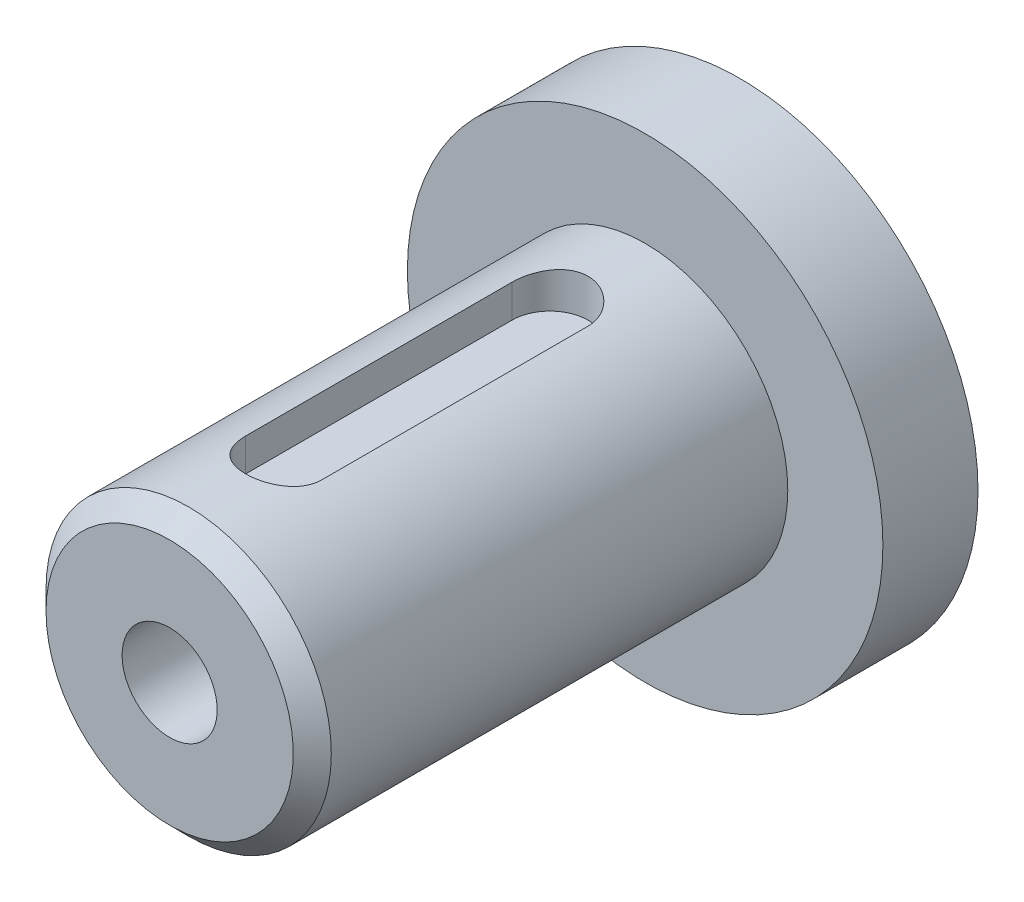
ISO-10303-21;
HEADER;
FILE_DESCRIPTION(('STEP AP214'),'2;1');
FILE_NAME('part.step','',(''),(''),'','','');
FILE_SCHEMA(('AUTOMOTIVE_DESIGN { 1 0 10303 214 1 1 1 1 }'));
ENDSEC;
DATA;
#1=APPLICATION_CONTEXT('core data for automotive mechanical design processes');
#2=APPLICATION_PROTOCOL_DEFINITION('international standard','automotive_design',2000,#1);
#3=PRODUCT_CONTEXT('',#1,'mechanical');
#4=PRODUCT('Part','Part','',(#3));
#5=PRODUCT_RELATED_PRODUCT_CATEGORY('part','',(#4));
#6=PRODUCT_DEFINITION_FORMATION('','',#4);
#7=PRODUCT_DEFINITION_CONTEXT('part definition',#1,'design');
#8=PRODUCT_DEFINITION('design','',#6,#7);
#9=PRODUCT_DEFINITION_SHAPE('','',#8);
#10=(LENGTH_UNIT() NAMED_UNIT(*) SI_UNIT(.MILLI.,.METRE.));
#11=(NAMED_UNIT(*) PLANE_ANGLE_UNIT() SI_UNIT($,.RADIAN.));
#12=(NAMED_UNIT(*) SI_UNIT($,.STERADIAN.) SOLID_ANGLE_UNIT());
#13=UNCERTAINTY_MEASURE_WITH_UNIT(LENGTH_MEASURE(1.E-05),#10,'distance_accuracy_value','');
#14=(GEOMETRIC_REPRESENTATION_CONTEXT(3) GLOBAL_UNCERTAINTY_ASSIGNED_CONTEXT((#13)) GLOBAL_UNIT_ASSIGNED_CONTEXT((#10,
#11,#12)) REPRESENTATION_CONTEXT('',''));
#15=CARTESIAN_POINT('',(0.,0.,0.));
#16=DIRECTION('',(0.,0.,1.));
#17=DIRECTION('',(1.,0.,0.));
#18=AXIS2_PLACEMENT_3D('',#15,#16,#17);
#19=CARTESIAN_POINT('',(0.,0.,10.));
#20=DIRECTION('',(0.,0.,1.));
#21=DIRECTION('',(0.,-1.,0.));
#22=AXIS2_PLACEMENT_3D('',#19,#20,#21);
#23=CONICAL_SURFACE('',#22,5.,1.02974425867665);
#24=CARTESIAN_POINT('',(0.,0.,10.));
#25=DIRECTION('',(0.,0.,1.));
#26=DIRECTION('',(0.,-1.,0.));
#27=AXIS2_PLACEMENT_3D('',#24,#25,#26);
#28=CIRCLE('',#27,5.);
#29=CARTESIAN_POINT('',(0.,-5.,10.));
#30=VERTEX_POINT('',#29);
#31=EDGE_CURVE('E141',#30,#30,#28,.T.);
#32=ORIENTED_EDGE('',*,*,#31,.T.);
#33=EDGE_LOOP('',(#32));
#34=FACE_BOUND('',#33,.T.);
#35=CARTESIAN_POINT('',(0.,0.,6.9956969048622));
#36=VERTEX_POINT('',#35);
#37=VERTEX_LOOP('',#36);
#38=FACE_BOUND('',#37,.T.);
#39=ADVANCED_FACE('F16',(#34,#38),#23,.F.);
#40=CARTESIAN_POINT('',(0.,0.,-10.));
#41=DIRECTION('',(0.,0.,1.));
#42=DIRECTION('',(1.,0.,0.));
#43=AXIS2_PLACEMENT_3D('',#40,#41,#42);
#44=PLANE('',#43);
#45=CARTESIAN_POINT('',(0.,0.,-10.));
#46=DIRECTION('',(0.,0.,-1.));
#47=DIRECTION('',(-1.,0.,0.));
#48=AXIS2_PLACEMENT_3D('',#45,#46,#47);
#49=CIRCLE('',#48,25.);
#50=CARTESIAN_POINT('',(-25.,0.,-10.));
#51=VERTEX_POINT('',#50);
#52=EDGE_CURVE('E20',#51,#51,#49,.F.);
#53=ORIENTED_EDGE('',*,*,#52,.F.);
#54=EDGE_LOOP('',(#53));
#55=FACE_BOUND('',#54,.T.);
#56=ADVANCED_FACE('F62',(#55),#44,.F.);
#57=CARTESIAN_POINT('',(0.,11.,24.));
#58=DIRECTION('',(0.,1.,0.));
#59=DIRECTION('',(0.,0.,1.));
#60=AXIS2_PLACEMENT_3D('',#57,#58,#59);
#61=PLANE('',#60);
#62=CARTESIAN_POINT('',(0.,11.,38.));
#63=DIRECTION('',(0.,-1.,0.));
#64=DIRECTION('',(0.,0.,-1.));
#65=AXIS2_PLACEMENT_3D('',#62,#63,#64);
#66=CIRCLE('',#65,4.);
#67=CARTESIAN_POINT('',(-4.,11.,38.));
#68=VERTEX_POINT('',#67);
#69=CARTESIAN_POINT('',(4.,11.,38.));
#70=VERTEX_POINT('',#69);
#71=EDGE_CURVE('E133',#68,#70,#66,.F.);
#72=ORIENTED_EDGE('',*,*,#71,.T.);
#73=DIRECTION('',(0.,0.,-1.));
#74=VECTOR('',#73,1.);
#75=CARTESIAN_POINT('',(4.,11.,38.));
#76=LINE('',#75,#74);
#77=CARTESIAN_POINT('',(4.,11.,10.));
#78=VERTEX_POINT('',#77);
#79=EDGE_CURVE('E57',#70,#78,#76,.T.);
#80=ORIENTED_EDGE('',*,*,#79,.T.);
#81=CARTESIAN_POINT('',(0.,11.,10.));
#82=DIRECTION('',(0.,-1.,0.));
#83=DIRECTION('',(0.,0.,-1.));
#84=AXIS2_PLACEMENT_3D('',#81,#82,#83);
#85=CIRCLE('',#84,4.);
#86=CARTESIAN_POINT('',(-4.,11.,10.));
#87=VERTEX_POINT('',#86);
#88=EDGE_CURVE('E136',#78,#87,#85,.F.);
#89=ORIENTED_EDGE('',*,*,#88,.T.);
#90=DIRECTION('',(0.,0.,1.));
#91=VECTOR('',#90,1.);
#92=CARTESIAN_POINT('',(-4.,11.,10.));
#93=LINE('',#92,#91);
#94=EDGE_CURVE('E158',#87,#68,#93,.T.);
#95=ORIENTED_EDGE('',*,*,#94,.T.);
#96=EDGE_LOOP('',(#72,#80,#89,#95));
#97=FACE_BOUND('',#96,.T.);
#98=ADVANCED_FACE('F67',(#97),#61,.T.);
#99=CARTESIAN_POINT('',(0.,0.,50.));
#100=DIRECTION('',(0.,0.,-1.));
#101=DIRECTION('',(0.,1.,0.));
#102=AXIS2_PLACEMENT_3D('',#99,#100,#101);
#103=CYLINDRICAL_SURFACE('',#102,5.);
#104=ORIENTED_EDGE('',*,*,#31,.F.);
#105=EDGE_LOOP('',(#104));
#106=FACE_BOUND('',#105,.T.);
#107=CARTESIAN_POINT('',(0.,0.,50.));
#108=DIRECTION('',(0.,0.,-1.));
#109=DIRECTION('',(0.,1.,0.));
#110=AXIS2_PLACEMENT_3D('',#107,#108,#109);
#111=CIRCLE('',#110,5.);
#112=CARTESIAN_POINT('',(0.,5.,50.));
#113=VERTEX_POINT('',#112);
#114=EDGE_CURVE('E128',#113,#113,#111,.F.);
#115=ORIENTED_EDGE('',*,*,#114,.T.);
#116=EDGE_LOOP('',(#115));
#117=FACE_BOUND('',#116,.T.);
#118=ADVANCED_FACE('F18',(#106,#117),#103,.F.);
#119=CARTESIAN_POINT('',(0.,0.,0.));
#120=DIRECTION('',(0.,0.,-1.));
#121=DIRECTION('',(-1.,0.,0.));
#122=AXIS2_PLACEMENT_3D('',#119,#120,#121);
#123=CYLINDRICAL_SURFACE('',#122,25.);
#124=ORIENTED_EDGE('',*,*,#52,.T.);
#125=EDGE_LOOP('',(#124));
#126=FACE_BOUND('',#125,.T.);
#127=CARTESIAN_POINT('',(0.,0.,0.));
#128=DIRECTION('',(0.,0.,-1.));
#129=DIRECTION('',(-1.,0.,0.));
#130=AXIS2_PLACEMENT_3D('',#127,#128,#129);
#131=CIRCLE('',#130,25.);
#132=CARTESIAN_POINT('',(-25.,0.,0.));
#133=VERTEX_POINT('',#132);
#134=EDGE_CURVE('E126',#133,#133,#131,.F.);
#135=ORIENTED_EDGE('',*,*,#134,.F.);
#136=EDGE_LOOP('',(#135));
#137=FACE_BOUND('',#136,.T.);
#138=ADVANCED_FACE('F169',(#126,#137),#123,.T.);
#139=CARTESIAN_POINT('',(0.,15.,10.));
#140=DIRECTION('',(0.,-1.,0.));
#141=DIRECTION('',(0.,0.,-1.));
#142=AXIS2_PLACEMENT_3D('',#139,#140,#141);
#143=CYLINDRICAL_SURFACE('',#142,4.);
#144=ORIENTED_EDGE('',*,*,#88,.F.);
#145=DIRECTION('',(0.,1.,0.));
#146=VECTOR('',#145,1.);
#147=CARTESIAN_POINT('',(4.,15.,10.));
#148=LINE('',#147,#146);
#149=CARTESIAN_POINT('',(4.,14.456832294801,10.));
#150=VERTEX_POINT('',#149);
#151=EDGE_CURVE('E138',#78,#150,#148,.T.);
#152=ORIENTED_EDGE('',*,*,#151,.T.);
#153=CARTESIAN_POINT('',(-4.,14.456832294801,10.));
#154=CARTESIAN_POINT('',(-4.00001309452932,14.4568189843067,9.88964181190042));
#155=CARTESIAN_POINT('',(-3.9954331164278,14.4580956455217,9.77929158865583));
#156=CARTESIAN_POINT('',(-3.97718876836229,14.463130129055,9.55942156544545));
#157=CARTESIAN_POINT('',(-3.96352608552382,14.4668874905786,9.44990161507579));
#158=CARTESIAN_POINT('',(-3.92725701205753,14.4767740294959,9.23269861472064));
#159=CARTESIAN_POINT('',(-3.9046698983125,14.4828980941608,9.12501212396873));
#160=CARTESIAN_POINT('',(-3.85076546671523,14.4973231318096,8.91202524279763));
#161=CARTESIAN_POINT('',(-3.81944799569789,14.5056241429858,8.80672489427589));
#162=CARTESIAN_POINT('',(-3.71275524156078,14.5334415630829,8.49553303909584));
#163=CARTESIAN_POINT('',(-3.62460040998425,14.5558837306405,8.29411818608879));
#164=CARTESIAN_POINT('',(-3.41695360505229,14.6060180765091,7.90897292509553));
#165=CARTESIAN_POINT('',(-3.29745234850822,14.6337118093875,7.7252477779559));
#166=CARTESIAN_POINT('',(-3.02731689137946,14.6919987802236,7.37604663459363));
#167=CARTESIAN_POINT('',(-2.87604640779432,14.7226429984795,7.21107044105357));
#168=CARTESIAN_POINT('',(-2.54799127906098,14.7829465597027,6.90846910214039));
#169=CARTESIAN_POINT('',(-2.37119756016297,14.8126055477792,6.77085372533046));
#170=CARTESIAN_POINT('',(-1.99358309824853,14.8681744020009,6.52476686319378));
#171=CARTESIAN_POINT('',(-1.79241548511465,14.894014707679,6.41681104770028));
#172=CARTESIAN_POINT('',(-1.3741175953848,14.9384017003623,6.23655240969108));
#173=CARTESIAN_POINT('',(-1.15700689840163,14.9569571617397,6.16420666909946));
#174=CARTESIAN_POINT('',(-0.782359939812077,14.9803695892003,6.07410246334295));
#175=CARTESIAN_POINT('',(-0.627304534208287,14.9876923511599,6.04636352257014));
#176=CARTESIAN_POINT('',(-0.314853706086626,14.9975096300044,6.00930907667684));
#177=CARTESIAN_POINT('',(-0.157458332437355,15.0000042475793,5.9999931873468));
#178=CARTESIAN_POINT('',(0.220420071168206,14.9999940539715,6.00000953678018));
#179=CARTESIAN_POINT('',(0.440963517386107,14.9950912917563,6.01828798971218));
#180=CARTESIAN_POINT('',(0.875763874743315,14.9759985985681,6.09081667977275));
#181=CARTESIAN_POINT('',(1.09001471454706,14.9617999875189,6.14510053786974));
#182=CARTESIAN_POINT('',(1.50578787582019,14.9256858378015,6.28774616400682));
#183=CARTESIAN_POINT('',(1.7073285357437,14.9037817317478,6.376057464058));
#184=CARTESIAN_POINT('',(2.09272123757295,14.8545720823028,6.58408304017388));
#185=CARTESIAN_POINT('',(2.27657335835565,14.8272665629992,6.70379717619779));
#186=CARTESIAN_POINT('',(2.62565449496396,14.7694930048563,6.97416337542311));
#187=CARTESIAN_POINT('',(2.79041516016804,14.738970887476,7.12540858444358));
#188=CARTESIAN_POINT('',(3.09256794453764,14.6785495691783,7.45328993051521));
#189=CARTESIAN_POINT('',(3.22995522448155,14.6486504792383,7.62993054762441));
#190=CARTESIAN_POINT('',(3.47576504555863,14.5923023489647,8.00734886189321));
#191=CARTESIAN_POINT('',(3.58363993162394,14.5659226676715,8.20849416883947));
#192=CARTESIAN_POINT('',(3.76379877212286,14.5204168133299,8.62683450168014));
#193=CARTESIAN_POINT('',(3.83611089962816,14.5012849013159,8.84401666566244));
#194=CARTESIAN_POINT('',(3.9260816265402,14.4771319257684,9.21861127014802));
#195=CARTESIAN_POINT('',(3.95375335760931,14.4695705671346,9.37352744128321));
#196=CARTESIAN_POINT('',(3.99072640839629,14.4593983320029,9.68559999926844));
#197=CARTESIAN_POINT('',(4.00003858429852,14.456784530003,9.84275500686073));
#198=CARTESIAN_POINT('',(4.,14.456832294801,10.));
#199=B_SPLINE_CURVE_WITH_KNOTS('',3,(#153,#154,#155,#156,#157,#158,#159,#160,#161,#162,#163,
#164,#165,#166,#167,#168,#169,#170,#171,#172,#173,#174,#175,#176,#177,#178,#179,#180,#181,#182,
#183,#184,#185,#186,#187,#188,#189,#190,#191,#192,#193,#194,#195,#196,#197,#198),.UNSPECIFIED.,
.F.,.F.,(4,2,2,2,2,2,2,2,2,2,2,2,2,2,2,2,2,2,2,2,2,2,4),(0.,0.3309585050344,0.66185555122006,
0.992041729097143,1.32223370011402,1.9819182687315,2.64179842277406,3.31643087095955,
3.99130375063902,4.67725851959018,5.36238452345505,5.83435156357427,6.306308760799,
6.96698411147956,7.62827725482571,8.28859334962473,8.94890649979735,9.62299055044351,
10.2971936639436,10.9831693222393,11.6686006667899,12.1401499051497,12.6114202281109),.UNSPECIFIED.);
#200=CARTESIAN_POINT('',(-4.,14.456832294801,10.));
#201=VERTEX_POINT('',#200);
#202=EDGE_CURVE('E87',#201,#150,#199,.T.);
#203=ORIENTED_EDGE('',*,*,#202,.F.);
#204=DIRECTION('',(0.,1.,0.));
#205=VECTOR('',#204,1.);
#206=CARTESIAN_POINT('',(-4.,15.,10.));
#207=LINE('',#206,#205);
#208=EDGE_CURVE('E134',#201,#87,#207,.F.);
#209=ORIENTED_EDGE('',*,*,#208,.T.);
#210=EDGE_LOOP('',(#144,#152,#203,#209));
#211=FACE_BOUND('',#210,.T.);
#212=ADVANCED_FACE('F168',(#211),#143,.F.);
#213=CARTESIAN_POINT('',(4.,15.,38.));
#214=DIRECTION('',(1.,0.,0.));
#215=DIRECTION('',(0.,0.,-1.));
#216=AXIS2_PLACEMENT_3D('',#213,#214,#215);
#217=PLANE('',#216);
#218=ORIENTED_EDGE('',*,*,#151,.F.);
#219=ORIENTED_EDGE('',*,*,#79,.F.);
#220=DIRECTION('',(0.,-1.,0.));
#221=VECTOR('',#220,1.);
#222=CARTESIAN_POINT('',(4.,15.,38.));
#223=LINE('',#222,#221);
#224=CARTESIAN_POINT('',(4.,14.456832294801,38.));
#225=VERTEX_POINT('',#224);
#226=EDGE_CURVE('E135',#70,#225,#223,.F.);
#227=ORIENTED_EDGE('',*,*,#226,.T.);
#228=DIRECTION('',(0.,0.,1.));
#229=VECTOR('',#228,1.);
#230=CARTESIAN_POINT('',(3.99999999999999,14.456832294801,0.));
#231=LINE('',#230,#229);
#232=EDGE_CURVE('E102',#150,#225,#231,.T.);
#233=ORIENTED_EDGE('',*,*,#232,.F.);
#234=EDGE_LOOP('',(#218,#219,#227,#233));
#235=FACE_BOUND('',#234,.T.);
#236=ADVANCED_FACE('F111',(#235),#217,.F.);
#237=CARTESIAN_POINT('',(0.,15.,38.));
#238=DIRECTION('',(0.,-1.,0.));
#239=DIRECTION('',(0.,0.,-1.));
#240=AXIS2_PLACEMENT_3D('',#237,#238,#239);
#241=CYLINDRICAL_SURFACE('',#240,4.);
#242=ORIENTED_EDGE('',*,*,#71,.F.);
#243=DIRECTION('',(0.,1.,0.));
#244=VECTOR('',#243,1.);
#245=CARTESIAN_POINT('',(-4.,15.,38.));
#246=LINE('',#245,#244);
#247=CARTESIAN_POINT('',(-4.,14.456832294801,38.));
#248=VERTEX_POINT('',#247);
#249=EDGE_CURVE('E35',#68,#248,#246,.T.);
#250=ORIENTED_EDGE('',*,*,#249,.T.);
#251=CARTESIAN_POINT('',(4.,14.456832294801,38.));
#252=CARTESIAN_POINT('',(4.00001309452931,14.4568189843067,38.1103581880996));
#253=CARTESIAN_POINT('',(3.99543311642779,14.4580956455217,38.2207084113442));
#254=CARTESIAN_POINT('',(3.97718876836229,14.463130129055,38.4405784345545));
#255=CARTESIAN_POINT('',(3.96352608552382,14.4668874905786,38.5500983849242));
#256=CARTESIAN_POINT('',(3.92725701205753,14.4767740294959,38.7673013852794));
#257=CARTESIAN_POINT('',(3.9046698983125,14.4828980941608,38.8749878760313));
#258=CARTESIAN_POINT('',(3.85076546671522,14.4973231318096,39.0879747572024));
#259=CARTESIAN_POINT('',(3.81944799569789,14.5056241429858,39.1932751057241));
#260=CARTESIAN_POINT('',(3.71275524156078,14.5334415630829,39.5044669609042));
#261=CARTESIAN_POINT('',(3.62460040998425,14.5558837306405,39.7058818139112));
#262=CARTESIAN_POINT('',(3.41695360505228,14.6060180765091,40.0910270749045));
#263=CARTESIAN_POINT('',(3.29745234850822,14.6337118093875,40.2747522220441));
#264=CARTESIAN_POINT('',(3.02731689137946,14.6919987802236,40.6239533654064));
#265=CARTESIAN_POINT('',(2.87604640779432,14.7226429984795,40.7889295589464));
#266=CARTESIAN_POINT('',(2.54799127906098,14.7829465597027,41.0915308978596));
#267=CARTESIAN_POINT('',(2.37119756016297,14.8126055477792,41.2291462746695));
#268=CARTESIAN_POINT('',(1.99358309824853,14.8681744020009,41.4752331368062));
#269=CARTESIAN_POINT('',(1.79241548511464,14.894014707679,41.5831889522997));
#270=CARTESIAN_POINT('',(1.37411759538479,14.9384017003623,41.7634475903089));
#271=CARTESIAN_POINT('',(1.15700689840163,14.9569571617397,41.8357933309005));
#272=CARTESIAN_POINT('',(0.782359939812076,14.9803695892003,41.9258975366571));
#273=CARTESIAN_POINT('',(0.627304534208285,14.9876923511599,41.9536364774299));
#274=CARTESIAN_POINT('',(0.314853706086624,14.9975096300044,41.9906909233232));
#275=CARTESIAN_POINT('',(0.157458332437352,15.0000042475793,42.0000068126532));
#276=CARTESIAN_POINT('',(-0.220420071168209,14.9999940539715,41.9999904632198));
#277=CARTESIAN_POINT('',(-0.44096351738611,14.9950912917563,41.9817120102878));
#278=CARTESIAN_POINT('',(-0.875763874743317,14.9759985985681,41.9091833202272));
#279=CARTESIAN_POINT('',(-1.09001471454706,14.9617999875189,41.8548994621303));
#280=CARTESIAN_POINT('',(-1.50578787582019,14.9256858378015,41.7122538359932));
#281=CARTESIAN_POINT('',(-1.7073285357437,14.9037817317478,41.623942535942));
#282=CARTESIAN_POINT('',(-2.09272123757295,14.8545720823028,41.4159169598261));
#283=CARTESIAN_POINT('',(-2.27657335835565,14.8272665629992,41.2962028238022));
#284=CARTESIAN_POINT('',(-2.62565449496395,14.7694930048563,41.0258366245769));
#285=CARTESIAN_POINT('',(-2.79041516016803,14.738970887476,40.8745914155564));
#286=CARTESIAN_POINT('',(-3.09256794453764,14.6785495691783,40.5467100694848));
#287=CARTESIAN_POINT('',(-3.22995522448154,14.6486504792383,40.3700694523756));
#288=CARTESIAN_POINT('',(-3.47576504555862,14.5923023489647,39.9926511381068));
#289=CARTESIAN_POINT('',(-3.58363993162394,14.5659226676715,39.7915058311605));
#290=CARTESIAN_POINT('',(-3.76379877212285,14.5204168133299,39.3731654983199));
#291=CARTESIAN_POINT('',(-3.83611089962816,14.5012849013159,39.1559833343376));
#292=CARTESIAN_POINT('',(-3.9260816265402,14.4771319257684,38.781388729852));
#293=CARTESIAN_POINT('',(-3.95375335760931,14.4695705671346,38.6264725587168));
#294=CARTESIAN_POINT('',(-3.99072640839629,14.4593983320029,38.3144000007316));
#295=CARTESIAN_POINT('',(-4.00003858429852,14.456784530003,38.1572449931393));
#296=CARTESIAN_POINT('',(-3.99999999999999,14.456832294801,38.));
#297=B_SPLINE_CURVE_WITH_KNOTS('',3,(#251,#252,#253,#254,#255,#256,#257,#258,#259,#260,#261,
#262,#263,#264,#265,#266,#267,#268,#269,#270,#271,#272,#273,#274,#275,#276,#277,#278,#279,#280,
#281,#282,#283,#284,#285,#286,#287,#288,#289,#290,#291,#292,#293,#294,#295,#296),.UNSPECIFIED.,
.F.,.F.,(4,2,2,2,2,2,2,2,2,2,2,2,2,2,2,2,2,2,2,2,2,2,4),(0.,0.330958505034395,0.661855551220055,
0.992041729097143,1.32223370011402,1.98191826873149,2.64179842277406,3.31643087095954,
3.99130375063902,4.67725851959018,5.36238452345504,5.83435156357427,6.30630876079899,
6.96698411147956,7.62827725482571,8.28859334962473,8.94890649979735,9.62299055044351,
10.2971936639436,10.9831693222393,11.6686006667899,12.1401499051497,12.6114202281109),.UNSPECIFIED.);
#298=EDGE_CURVE('E94',#225,#248,#297,.T.);
#299=ORIENTED_EDGE('',*,*,#298,.F.);
#300=ORIENTED_EDGE('',*,*,#226,.F.);
#301=EDGE_LOOP('',(#242,#250,#299,#300));
#302=FACE_BOUND('',#301,.T.);
#303=ADVANCED_FACE('F105',(#302),#241,.F.);
#304=CARTESIAN_POINT('',(-4.,15.,10.));
#305=DIRECTION('',(-1.,0.,0.));
#306=DIRECTION('',(0.,0.,1.));
#307=AXIS2_PLACEMENT_3D('',#304,#305,#306);
#308=PLANE('',#307);
#309=ORIENTED_EDGE('',*,*,#249,.F.);
#310=ORIENTED_EDGE('',*,*,#94,.F.);
#311=ORIENTED_EDGE('',*,*,#208,.F.);
#312=DIRECTION('',(0.,0.,1.));
#313=VECTOR('',#312,1.);
#314=CARTESIAN_POINT('',(-3.99999999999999,14.456832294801,0.));
#315=LINE('',#314,#313);
#316=EDGE_CURVE('E101',#248,#201,#315,.F.);
#317=ORIENTED_EDGE('',*,*,#316,.F.);
#318=EDGE_LOOP('',(#309,#310,#311,#317));
#319=FACE_BOUND('',#318,.T.);
#320=ADVANCED_FACE('F110',(#319),#308,.F.);
#321=CARTESIAN_POINT('',(0.,0.,50.));
#322=DIRECTION('',(0.,0.,-1.));
#323=DIRECTION('',(-1.,0.,0.));
#324=AXIS2_PLACEMENT_3D('',#321,#322,#323);
#325=PLANE('',#324);
#326=ORIENTED_EDGE('',*,*,#114,.F.);
#327=EDGE_LOOP('',(#326));
#328=FACE_BOUND('',#327,.T.);
#329=CARTESIAN_POINT('',(0.,0.,50.0000000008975));
#330=DIRECTION('',(0.,0.,-1.));
#331=DIRECTION('',(-1.,0.,0.));
#332=AXIS2_PLACEMENT_3D('',#329,#330,#331);
#333=CIRCLE('',#332,13.0000000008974);
#334=CARTESIAN_POINT('',(-13.0000000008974,0.,50.0000000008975));
#335=VERTEX_POINT('',#334);
#336=EDGE_CURVE('E103',#335,#335,#333,.T.);
#337=ORIENTED_EDGE('',*,*,#336,.F.);
#338=EDGE_LOOP('',(#337));
#339=FACE_BOUND('',#338,.T.);
#340=ADVANCED_FACE('F114',(#328,#339),#325,.F.);
#341=CARTESIAN_POINT('',(0.,0.,0.));
#342=DIRECTION('',(0.,0.,1.));
#343=DIRECTION('',(1.,0.,0.));
#344=AXIS2_PLACEMENT_3D('',#341,#342,#343);
#345=PLANE('',#344);
#346=CARTESIAN_POINT('',(0.,0.,0.));
#347=DIRECTION('',(0.,0.,1.));
#348=DIRECTION('',(1.,0.,0.));
#349=AXIS2_PLACEMENT_3D('',#346,#347,#348);
#350=CIRCLE('',#349,15.);
#351=CARTESIAN_POINT('',(15.,0.,0.));
#352=VERTEX_POINT('',#351);
#353=EDGE_CURVE('E26',#352,#352,#350,.T.);
#354=ORIENTED_EDGE('',*,*,#353,.F.);
#355=EDGE_LOOP('',(#354));
#356=FACE_BOUND('',#355,.T.);
#357=ORIENTED_EDGE('',*,*,#134,.T.);
#358=EDGE_LOOP('',(#357));
#359=FACE_BOUND('',#358,.T.);
#360=ADVANCED_FACE('F78',(#356,#359),#345,.T.);
#361=CARTESIAN_POINT('',(0.,0.,47.9999999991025));
#362=DIRECTION('',(0.,0.,-1.));
#363=DIRECTION('',(-1.,0.,0.));
#364=AXIS2_PLACEMENT_3D('',#361,#362,#363);
#365=CONICAL_SURFACE('',#364,14.9999999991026,0.7853981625);
#366=CARTESIAN_POINT('',(0.,0.,48.));
#367=DIRECTION('',(0.,0.,1.));
#368=DIRECTION('',(1.,0.,0.));
#369=AXIS2_PLACEMENT_3D('',#366,#367,#368);
#370=CIRCLE('',#369,15.);
#371=CARTESIAN_POINT('',(15.,0.,48.));
#372=VERTEX_POINT('',#371);
#373=EDGE_CURVE('E10',#372,#372,#370,.F.);
#374=ORIENTED_EDGE('',*,*,#373,.F.);
#375=EDGE_LOOP('',(#374));
#376=FACE_BOUND('',#375,.T.);
#377=ORIENTED_EDGE('',*,*,#336,.T.);
#378=EDGE_LOOP('',(#377));
#379=FACE_BOUND('',#378,.T.);
#380=ADVANCED_FACE('F74',(#376,#379),#365,.T.);
#381=CARTESIAN_POINT('',(0.,0.,0.));
#382=DIRECTION('',(0.,0.,1.));
#383=DIRECTION('',(1.,0.,0.));
#384=AXIS2_PLACEMENT_3D('',#381,#382,#383);
#385=CYLINDRICAL_SURFACE('',#384,15.);
#386=ORIENTED_EDGE('',*,*,#353,.T.);
#387=EDGE_LOOP('',(#386));
#388=FACE_BOUND('',#387,.T.);
#389=ORIENTED_EDGE('',*,*,#373,.T.);
#390=EDGE_LOOP('',(#389));
#391=FACE_BOUND('',#390,.T.);
#392=ORIENTED_EDGE('',*,*,#298,.T.);
#393=ORIENTED_EDGE('',*,*,#316,.T.);
#394=ORIENTED_EDGE('',*,*,#202,.T.);
#395=ORIENTED_EDGE('',*,*,#232,.T.);
#396=EDGE_LOOP('',(#392,#393,#394,#395));
#397=FACE_BOUND('',#396,.T.);
#398=ADVANCED_FACE('F72',(#388,#391,#397),#385,.T.);
#399=CLOSED_SHELL('',(#39,#56,#98,#118,#138,#212,#236,#303,#320,#340,#360,#380,#398));
#400=MANIFOLD_SOLID_BREP('B1',#399);
#401=ADVANCED_BREP_SHAPE_REPRESENTATION('',(#18,#400),#14);
#402=SHAPE_DEFINITION_REPRESENTATION(#9,#401);
ENDSEC;
END-ISO-10303-21;
